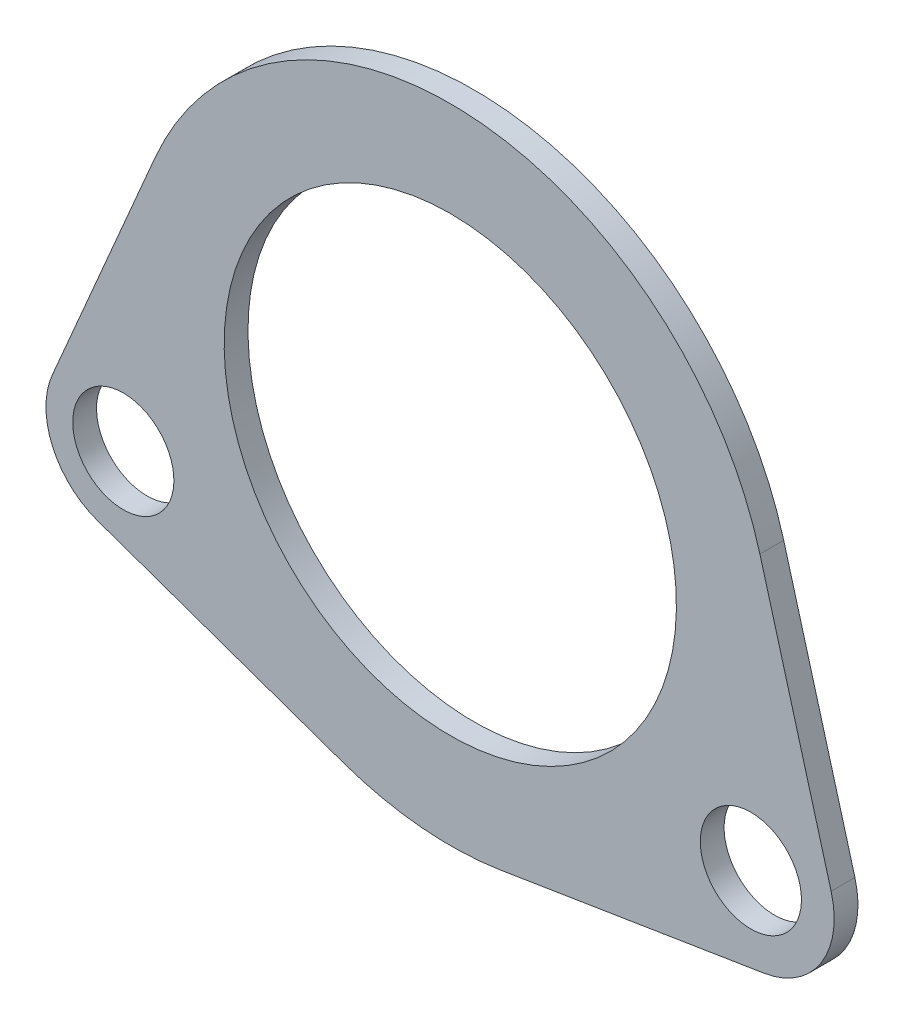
ISO-10303-21;
HEADER;
FILE_DESCRIPTION(('STEP AP214'),'2;1');
FILE_NAME('part.step','',(''),(''),'','','');
FILE_SCHEMA(('AUTOMOTIVE_DESIGN { 1 0 10303 214 1 1 1 1 }'));
ENDSEC;
DATA;
#1=APPLICATION_CONTEXT('core data for automotive mechanical design processes');
#2=APPLICATION_PROTOCOL_DEFINITION('international standard','automotive_design',2000,#1);
#3=PRODUCT_CONTEXT('',#1,'mechanical');
#4=PRODUCT('Part','Part','',(#3));
#5=PRODUCT_RELATED_PRODUCT_CATEGORY('part','',(#4));
#6=PRODUCT_DEFINITION_FORMATION('','',#4);
#7=PRODUCT_DEFINITION_CONTEXT('part definition',#1,'design');
#8=PRODUCT_DEFINITION('design','',#6,#7);
#9=PRODUCT_DEFINITION_SHAPE('','',#8);
#10=(LENGTH_UNIT() NAMED_UNIT(*) SI_UNIT(.MILLI.,.METRE.));
#11=(NAMED_UNIT(*) PLANE_ANGLE_UNIT() SI_UNIT($,.RADIAN.));
#12=(NAMED_UNIT(*) SI_UNIT($,.STERADIAN.) SOLID_ANGLE_UNIT());
#13=UNCERTAINTY_MEASURE_WITH_UNIT(LENGTH_MEASURE(1.E-05),#10,'distance_accuracy_value','');
#14=(GEOMETRIC_REPRESENTATION_CONTEXT(3) GLOBAL_UNCERTAINTY_ASSIGNED_CONTEXT((#13)) GLOBAL_UNIT_ASSIGNED_CONTEXT((#10,
#11,#12)) REPRESENTATION_CONTEXT('',''));
#15=CARTESIAN_POINT('',(0.,0.,0.));
#16=DIRECTION('',(0.,0.,1.));
#17=DIRECTION('',(1.,0.,0.));
#18=AXIS2_PLACEMENT_3D('',#15,#16,#17);
#19=CARTESIAN_POINT('',(27.8018102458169,-6.52052736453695,34.3685391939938));
#20=DIRECTION('',(0.,0.,-1.));
#21=DIRECTION('',(0.,1.,0.));
#22=AXIS2_PLACEMENT_3D('',#19,#20,#21);
#23=PLANE('',#22);
#24=CARTESIAN_POINT('',(2.54648871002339,9.6710980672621,34.3685391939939));
#25=DIRECTION('',(0.,0.,-1.));
#26=DIRECTION('',(0.,1.,0.));
#27=AXIS2_PLACEMENT_3D('',#24,#25,#26);
#28=CIRCLE('',#27,19.);
#29=CARTESIAN_POINT('',(2.54648871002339,28.6710980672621,34.368539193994));
#30=VERTEX_POINT('',#29);
#31=EDGE_CURVE('E226',#30,#30,#28,.T.);
#32=ORIENTED_EDGE('',*,*,#31,.F.);
#33=EDGE_LOOP('',(#32));
#34=FACE_BOUND('',#33,.T.);
#35=CARTESIAN_POINT('',(27.8018102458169,-6.52052736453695,34.3685391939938));
#36=DIRECTION('',(0.,0.,-1.));
#37=DIRECTION('',(0.,1.,0.));
#38=AXIS2_PLACEMENT_3D('',#35,#36,#37);
#39=CIRCLE('',#38,7.);
#40=CARTESIAN_POINT('',(34.5464049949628,-4.64691009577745,34.3685391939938));
#41=VERTEX_POINT('',#40);
#42=CARTESIAN_POINT('',(28.9144266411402,-13.4315392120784,34.3685391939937));
#43=VERTEX_POINT('',#42);
#44=EDGE_CURVE('E131',#41,#43,#39,.T.);
#45=ORIENTED_EDGE('',*,*,#44,.T.);
#46=DIRECTION('',(-0.987287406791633,-0.158945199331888,0.));
#47=VECTOR('',#46,1.);
#48=CARTESIAN_POINT('',(28.9144266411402,-13.4315392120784,34.3685391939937));
#49=LINE('',#48,#47);
#50=CARTESIAN_POINT('',(6.83800909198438,-16.985661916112,34.3685391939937));
#51=VERTEX_POINT('',#50);
#52=EDGE_CURVE('E108',#43,#51,#49,.T.);
#53=ORIENTED_EDGE('',*,*,#52,.T.);
#54=CARTESIAN_POINT('',(2.54648871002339,9.6710980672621,34.3685391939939));
#55=DIRECTION('',(0.,0.,-1.));
#56=DIRECTION('',(0.,1.,0.));
#57=AXIS2_PLACEMENT_3D('',#54,#55,#56);
#58=CIRCLE('',#57,27.);
#59=CARTESIAN_POINT('',(-6.4343922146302,-15.7914975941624,34.3685391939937));
#60=VERTEX_POINT('',#59);
#61=EDGE_CURVE('E134',#51,#60,#58,.T.);
#62=ORIENTED_EDGE('',*,*,#61,.T.);
#63=DIRECTION('',(-0.943059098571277,0.332625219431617,0.));
#64=VECTOR('',#63,1.);
#65=CARTESIAN_POINT('',(-6.4343922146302,-15.7914975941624,34.3685391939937));
#66=LINE('',#65,#64);
#67=CARTESIAN_POINT('',(-27.0904005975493,-8.50594218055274,34.3685391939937));
#68=VERTEX_POINT('',#67);
#69=EDGE_CURVE('E136',#60,#68,#66,.T.);
#70=ORIENTED_EDGE('',*,*,#69,.T.);
#71=CARTESIAN_POINT('',(-24.9283366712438,-2.37605803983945,34.3685391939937));
#72=DIRECTION('',(0.,0.,-1.));
#73=DIRECTION('',(0.,1.,0.));
#74=AXIS2_PLACEMENT_3D('',#71,#72,#73);
#75=CIRCLE('',#74,6.49999999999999);
#76=CARTESIAN_POINT('',(-30.901873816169,0.186529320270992,34.3685391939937));
#77=VERTEX_POINT('',#76);
#78=EDGE_CURVE('E138',#68,#77,#75,.T.);
#79=ORIENTED_EDGE('',*,*,#78,.T.);
#80=DIRECTION('',(0.394244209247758,0.919005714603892,0.));
#81=VECTOR('',#80,1.);
#82=CARTESIAN_POINT('',(-22.2666655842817,20.3156917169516,34.3685391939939));
#83=LINE('',#82,#81);
#84=CARTESIAN_POINT('',(-22.2666655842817,20.3156917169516,34.3685391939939));
#85=VERTEX_POINT('',#84);
#86=EDGE_CURVE('E140',#77,#85,#83,.T.);
#87=ORIENTED_EDGE('',*,*,#86,.T.);
#88=CARTESIAN_POINT('',(2.54648871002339,9.6710980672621,34.3685391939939));
#89=DIRECTION('',(0.,0.,-1.));
#90=DIRECTION('',(0.,1.,0.));
#91=AXIS2_PLACEMENT_3D('',#88,#89,#90);
#92=CIRCLE('',#91,27.);
#93=CARTESIAN_POINT('',(28.5613541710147,16.8979075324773,34.3685391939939));
#94=VERTEX_POINT('',#93);
#95=EDGE_CURVE('E49',#85,#94,#92,.T.);
#96=ORIENTED_EDGE('',*,*,#95,.T.);
#97=DIRECTION('',(0.267659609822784,-0.963513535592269,0.));
#98=VECTOR('',#97,1.);
#99=CARTESIAN_POINT('',(34.5464049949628,-4.64691009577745,34.3685391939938));
#100=LINE('',#99,#98);
#101=EDGE_CURVE('E44',#94,#41,#100,.T.);
#102=ORIENTED_EDGE('',*,*,#101,.T.);
#103=EDGE_LOOP('',(#45,#53,#62,#70,#79,#87,#96,#102));
#104=FACE_BOUND('',#103,.T.);
#105=CARTESIAN_POINT('',(27.8018102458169,-6.52052736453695,34.3685391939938));
#106=DIRECTION('',(0.,0.,-1.));
#107=DIRECTION('',(0.,1.,0.));
#108=AXIS2_PLACEMENT_3D('',#105,#106,#107);
#109=CIRCLE('',#108,4.25000000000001);
#110=CARTESIAN_POINT('',(27.8018102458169,-2.27052736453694,34.3685391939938));
#111=VERTEX_POINT('',#110);
#112=EDGE_CURVE('E113',#111,#111,#109,.T.);
#113=ORIENTED_EDGE('',*,*,#112,.F.);
#114=EDGE_LOOP('',(#113));
#115=FACE_BOUND('',#114,.T.);
#116=CARTESIAN_POINT('',(-24.9283366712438,-2.37605803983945,34.3685391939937));
#117=DIRECTION('',(0.,0.,-1.));
#118=DIRECTION('',(0.,1.,0.));
#119=AXIS2_PLACEMENT_3D('',#116,#117,#118);
#120=CIRCLE('',#119,4.25000000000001);
#121=CARTESIAN_POINT('',(-24.9283366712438,1.87394196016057,34.3685391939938));
#122=VERTEX_POINT('',#121);
#123=EDGE_CURVE('E215',#122,#122,#120,.T.);
#124=ORIENTED_EDGE('',*,*,#123,.F.);
#125=EDGE_LOOP('',(#124));
#126=FACE_BOUND('',#125,.T.);
#127=ADVANCED_FACE('F29',(#34,#104,#115,#126),#23,.T.);
#128=CARTESIAN_POINT('',(27.8018102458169,-6.52052736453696,36.3685391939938));
#129=DIRECTION('',(0.,0.,-1.));
#130=DIRECTION('',(0.,1.,0.));
#131=AXIS2_PLACEMENT_3D('',#128,#129,#130);
#132=PLANE('',#131);
#133=CARTESIAN_POINT('',(2.54648871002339,9.67109806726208,36.3685391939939));
#134=DIRECTION('',(0.,0.,-1.));
#135=DIRECTION('',(0.,1.,0.));
#136=AXIS2_PLACEMENT_3D('',#133,#134,#135);
#137=CIRCLE('',#136,19.);
#138=CARTESIAN_POINT('',(2.54648871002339,28.6710980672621,36.368539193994));
#139=VERTEX_POINT('',#138);
#140=EDGE_CURVE('E221',#139,#139,#137,.T.);
#141=ORIENTED_EDGE('',*,*,#140,.T.);
#142=EDGE_LOOP('',(#141));
#143=FACE_BOUND('',#142,.T.);
#144=CARTESIAN_POINT('',(27.8018102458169,-6.52052736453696,36.3685391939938));
#145=DIRECTION('',(0.,0.,-1.));
#146=DIRECTION('',(0.,1.,0.));
#147=AXIS2_PLACEMENT_3D('',#144,#145,#146);
#148=CIRCLE('',#147,7.);
#149=CARTESIAN_POINT('',(34.5464049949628,-4.64691009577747,36.3685391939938));
#150=VERTEX_POINT('',#149);
#151=CARTESIAN_POINT('',(28.9144266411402,-13.4315392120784,36.3685391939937));
#152=VERTEX_POINT('',#151);
#153=EDGE_CURVE('E99',#150,#152,#148,.T.);
#154=ORIENTED_EDGE('',*,*,#153,.F.);
#155=DIRECTION('',(0.267659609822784,-0.963513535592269,0.));
#156=VECTOR('',#155,1.);
#157=CARTESIAN_POINT('',(34.5464049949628,-4.64691009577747,36.3685391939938));
#158=LINE('',#157,#156);
#159=CARTESIAN_POINT('',(28.5613541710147,16.8979075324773,36.368539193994));
#160=VERTEX_POINT('',#159);
#161=EDGE_CURVE('E129',#160,#150,#158,.T.);
#162=ORIENTED_EDGE('',*,*,#161,.F.);
#163=CARTESIAN_POINT('',(2.54648871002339,9.67109806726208,36.3685391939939));
#164=DIRECTION('',(0.,0.,-1.));
#165=DIRECTION('',(0.,1.,0.));
#166=AXIS2_PLACEMENT_3D('',#163,#164,#165);
#167=CIRCLE('',#166,27.);
#168=CARTESIAN_POINT('',(-22.2666655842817,20.3156917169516,36.3685391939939));
#169=VERTEX_POINT('',#168);
#170=EDGE_CURVE('E127',#169,#160,#167,.T.);
#171=ORIENTED_EDGE('',*,*,#170,.F.);
#172=DIRECTION('',(0.394244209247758,0.919005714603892,0.));
#173=VECTOR('',#172,1.);
#174=CARTESIAN_POINT('',(-22.2666655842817,20.3156917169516,36.3685391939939));
#175=LINE('',#174,#173);
#176=CARTESIAN_POINT('',(-30.9018738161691,0.186529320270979,36.3685391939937));
#177=VERTEX_POINT('',#176);
#178=EDGE_CURVE('E125',#177,#169,#175,.T.);
#179=ORIENTED_EDGE('',*,*,#178,.F.);
#180=CARTESIAN_POINT('',(-24.9283366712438,-2.37605803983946,36.3685391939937));
#181=DIRECTION('',(0.,0.,-1.));
#182=DIRECTION('',(0.,1.,0.));
#183=AXIS2_PLACEMENT_3D('',#180,#181,#182);
#184=CIRCLE('',#183,6.49999999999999);
#185=CARTESIAN_POINT('',(-27.0904005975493,-8.50594218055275,36.3685391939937));
#186=VERTEX_POINT('',#185);
#187=EDGE_CURVE('E123',#186,#177,#184,.T.);
#188=ORIENTED_EDGE('',*,*,#187,.F.);
#189=DIRECTION('',(-0.943059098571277,0.332625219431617,0.));
#190=VECTOR('',#189,1.);
#191=CARTESIAN_POINT('',(-6.43439221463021,-15.7914975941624,36.3685391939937));
#192=LINE('',#191,#190);
#193=CARTESIAN_POINT('',(-6.43439221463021,-15.7914975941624,36.3685391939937));
#194=VERTEX_POINT('',#193);
#195=EDGE_CURVE('E121',#194,#186,#192,.T.);
#196=ORIENTED_EDGE('',*,*,#195,.F.);
#197=CARTESIAN_POINT('',(2.54648871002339,9.67109806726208,36.3685391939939));
#198=DIRECTION('',(0.,0.,-1.));
#199=DIRECTION('',(0.,1.,0.));
#200=AXIS2_PLACEMENT_3D('',#197,#198,#199);
#201=CIRCLE('',#200,27.);
#202=CARTESIAN_POINT('',(6.83800909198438,-16.985661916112,36.3685391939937));
#203=VERTEX_POINT('',#202);
#204=EDGE_CURVE('E101',#203,#194,#201,.T.);
#205=ORIENTED_EDGE('',*,*,#204,.F.);
#206=DIRECTION('',(-0.987287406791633,-0.158945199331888,0.));
#207=VECTOR('',#206,1.);
#208=CARTESIAN_POINT('',(28.9144266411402,-13.4315392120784,36.3685391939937));
#209=LINE('',#208,#207);
#210=EDGE_CURVE('E94',#152,#203,#209,.T.);
#211=ORIENTED_EDGE('',*,*,#210,.F.);
#212=EDGE_LOOP('',(#154,#162,#171,#179,#188,#196,#205,#211));
#213=FACE_BOUND('',#212,.T.);
#214=CARTESIAN_POINT('',(27.8018102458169,-6.52052736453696,36.3685391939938));
#215=DIRECTION('',(0.,0.,-1.));
#216=DIRECTION('',(0.,1.,0.));
#217=AXIS2_PLACEMENT_3D('',#214,#215,#216);
#218=CIRCLE('',#217,4.25000000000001);
#219=CARTESIAN_POINT('',(27.8018102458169,-2.27052736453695,36.3685391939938));
#220=VERTEX_POINT('',#219);
#221=EDGE_CURVE('E116',#220,#220,#218,.T.);
#222=ORIENTED_EDGE('',*,*,#221,.T.);
#223=EDGE_LOOP('',(#222));
#224=FACE_BOUND('',#223,.T.);
#225=CARTESIAN_POINT('',(-24.9283366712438,-2.37605803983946,36.3685391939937));
#226=DIRECTION('',(0.,0.,-1.));
#227=DIRECTION('',(0.,1.,0.));
#228=AXIS2_PLACEMENT_3D('',#225,#226,#227);
#229=CIRCLE('',#228,4.25000000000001);
#230=CARTESIAN_POINT('',(-24.9283366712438,1.87394196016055,36.3685391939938));
#231=VERTEX_POINT('',#230);
#232=EDGE_CURVE('E218',#231,#231,#229,.T.);
#233=ORIENTED_EDGE('',*,*,#232,.T.);
#234=EDGE_LOOP('',(#233));
#235=FACE_BOUND('',#234,.T.);
#236=ADVANCED_FACE('F95',(#143,#213,#224,#235),#132,.F.);
#237=CARTESIAN_POINT('',(27.8018102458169,-6.52052736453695,34.3685391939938));
#238=DIRECTION('',(0.,0.,1.));
#239=DIRECTION('',(0.,-1.,0.));
#240=AXIS2_PLACEMENT_3D('',#237,#238,#239);
#241=CYLINDRICAL_SURFACE('',#240,7.);
#242=ORIENTED_EDGE('',*,*,#153,.T.);
#243=DIRECTION('',(0.,0.,1.));
#244=VECTOR('',#243,1.);
#245=CARTESIAN_POINT('',(28.9144266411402,-13.4315392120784,34.3685391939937));
#246=LINE('',#245,#244);
#247=EDGE_CURVE('E11',#43,#152,#246,.T.);
#248=ORIENTED_EDGE('',*,*,#247,.F.);
#249=ORIENTED_EDGE('',*,*,#44,.F.);
#250=DIRECTION('',(0.,0.,1.));
#251=VECTOR('',#250,1.);
#252=CARTESIAN_POINT('',(34.5464049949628,-4.64691009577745,34.3685391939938));
#253=LINE('',#252,#251);
#254=EDGE_CURVE('E112',#41,#150,#253,.T.);
#255=ORIENTED_EDGE('',*,*,#254,.T.);
#256=EDGE_LOOP('',(#242,#248,#249,#255));
#257=FACE_BOUND('',#256,.T.);
#258=ADVANCED_FACE('F31',(#257),#241,.T.);
#259=CARTESIAN_POINT('',(28.9144266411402,-13.4315392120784,34.3685391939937));
#260=DIRECTION('',(-0.158945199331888,0.987287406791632,0.));
#261=DIRECTION('',(-0.987287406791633,-0.158945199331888,0.));
#262=AXIS2_PLACEMENT_3D('',#259,#260,#261);
#263=PLANE('',#262);
#264=ORIENTED_EDGE('',*,*,#210,.T.);
#265=DIRECTION('',(0.,0.,1.));
#266=VECTOR('',#265,1.);
#267=CARTESIAN_POINT('',(6.83800909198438,-16.985661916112,34.3685391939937));
#268=LINE('',#267,#266);
#269=EDGE_CURVE('E37',#51,#203,#268,.T.);
#270=ORIENTED_EDGE('',*,*,#269,.F.);
#271=ORIENTED_EDGE('',*,*,#52,.F.);
#272=ORIENTED_EDGE('',*,*,#247,.T.);
#273=EDGE_LOOP('',(#264,#270,#271,#272));
#274=FACE_BOUND('',#273,.T.);
#275=ADVANCED_FACE('F107',(#274),#263,.F.);
#276=CARTESIAN_POINT('',(2.54648871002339,9.6710980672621,34.3685391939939));
#277=DIRECTION('',(0.,0.,1.));
#278=DIRECTION('',(0.,-1.,0.));
#279=AXIS2_PLACEMENT_3D('',#276,#277,#278);
#280=CYLINDRICAL_SURFACE('',#279,27.);
#281=ORIENTED_EDGE('',*,*,#204,.T.);
#282=DIRECTION('',(0.,0.,1.));
#283=VECTOR('',#282,1.);
#284=CARTESIAN_POINT('',(-6.4343922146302,-15.7914975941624,34.3685391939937));
#285=LINE('',#284,#283);
#286=EDGE_CURVE('E157',#60,#194,#285,.T.);
#287=ORIENTED_EDGE('',*,*,#286,.F.);
#288=ORIENTED_EDGE('',*,*,#61,.F.);
#289=ORIENTED_EDGE('',*,*,#269,.T.);
#290=EDGE_LOOP('',(#281,#287,#288,#289));
#291=FACE_BOUND('',#290,.T.);
#292=ADVANCED_FACE('F161',(#291),#280,.T.);
#293=CARTESIAN_POINT('',(-6.4343922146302,-15.7914975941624,34.3685391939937));
#294=DIRECTION('',(0.332625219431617,0.943059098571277,0.));
#295=DIRECTION('',(-0.943059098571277,0.332625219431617,0.));
#296=AXIS2_PLACEMENT_3D('',#293,#294,#295);
#297=PLANE('',#296);
#298=ORIENTED_EDGE('',*,*,#195,.T.);
#299=DIRECTION('',(0.,0.,1.));
#300=VECTOR('',#299,1.);
#301=CARTESIAN_POINT('',(-27.0904005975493,-8.50594218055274,34.3685391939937));
#302=LINE('',#301,#300);
#303=EDGE_CURVE('E154',#68,#186,#302,.T.);
#304=ORIENTED_EDGE('',*,*,#303,.F.);
#305=ORIENTED_EDGE('',*,*,#69,.F.);
#306=ORIENTED_EDGE('',*,*,#286,.T.);
#307=EDGE_LOOP('',(#298,#304,#305,#306));
#308=FACE_BOUND('',#307,.T.);
#309=ADVANCED_FACE('F169',(#308),#297,.F.);
#310=CARTESIAN_POINT('',(-24.9283366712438,-2.37605803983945,34.3685391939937));
#311=DIRECTION('',(0.,0.,1.));
#312=DIRECTION('',(0.,-1.,0.));
#313=AXIS2_PLACEMENT_3D('',#310,#311,#312);
#314=CYLINDRICAL_SURFACE('',#313,6.49999999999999);
#315=ORIENTED_EDGE('',*,*,#187,.T.);
#316=DIRECTION('',(0.,0.,1.));
#317=VECTOR('',#316,1.);
#318=CARTESIAN_POINT('',(-30.901873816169,0.186529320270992,34.3685391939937));
#319=LINE('',#318,#317);
#320=EDGE_CURVE('E151',#77,#177,#319,.T.);
#321=ORIENTED_EDGE('',*,*,#320,.F.);
#322=ORIENTED_EDGE('',*,*,#78,.F.);
#323=ORIENTED_EDGE('',*,*,#303,.T.);
#324=EDGE_LOOP('',(#315,#321,#322,#323));
#325=FACE_BOUND('',#324,.T.);
#326=ADVANCED_FACE('F172',(#325),#314,.T.);
#327=CARTESIAN_POINT('',(-22.2666655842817,20.3156917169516,34.3685391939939));
#328=DIRECTION('',(0.919005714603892,-0.394244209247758,0.));
#329=DIRECTION('',(0.394244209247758,0.919005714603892,0.));
#330=AXIS2_PLACEMENT_3D('',#327,#328,#329);
#331=PLANE('',#330);
#332=ORIENTED_EDGE('',*,*,#178,.T.);
#333=DIRECTION('',(0.,0.,1.));
#334=VECTOR('',#333,1.);
#335=CARTESIAN_POINT('',(-22.2666655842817,20.3156917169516,34.3685391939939));
#336=LINE('',#335,#334);
#337=EDGE_CURVE('E148',#85,#169,#336,.T.);
#338=ORIENTED_EDGE('',*,*,#337,.F.);
#339=ORIENTED_EDGE('',*,*,#86,.F.);
#340=ORIENTED_EDGE('',*,*,#320,.T.);
#341=EDGE_LOOP('',(#332,#338,#339,#340));
#342=FACE_BOUND('',#341,.T.);
#343=ADVANCED_FACE('F177',(#342),#331,.F.);
#344=CARTESIAN_POINT('',(2.54648871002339,9.6710980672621,34.3685391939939));
#345=DIRECTION('',(0.,0.,1.));
#346=DIRECTION('',(0.,-1.,0.));
#347=AXIS2_PLACEMENT_3D('',#344,#345,#346);
#348=CYLINDRICAL_SURFACE('',#347,27.);
#349=ORIENTED_EDGE('',*,*,#170,.T.);
#350=DIRECTION('',(0.,0.,1.));
#351=VECTOR('',#350,1.);
#352=CARTESIAN_POINT('',(28.5613541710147,16.8979075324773,34.3685391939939));
#353=LINE('',#352,#351);
#354=EDGE_CURVE('E145',#94,#160,#353,.T.);
#355=ORIENTED_EDGE('',*,*,#354,.F.);
#356=ORIENTED_EDGE('',*,*,#95,.F.);
#357=ORIENTED_EDGE('',*,*,#337,.T.);
#358=EDGE_LOOP('',(#349,#355,#356,#357));
#359=FACE_BOUND('',#358,.T.);
#360=ADVANCED_FACE('F180',(#359),#348,.T.);
#361=CARTESIAN_POINT('',(34.5464049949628,-4.64691009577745,34.3685391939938));
#362=DIRECTION('',(-0.963513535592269,-0.267659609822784,0.));
#363=DIRECTION('',(0.267659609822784,-0.963513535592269,0.));
#364=AXIS2_PLACEMENT_3D('',#361,#362,#363);
#365=PLANE('',#364);
#366=ORIENTED_EDGE('',*,*,#161,.T.);
#367=ORIENTED_EDGE('',*,*,#254,.F.);
#368=ORIENTED_EDGE('',*,*,#101,.F.);
#369=ORIENTED_EDGE('',*,*,#354,.T.);
#370=EDGE_LOOP('',(#366,#367,#368,#369));
#371=FACE_BOUND('',#370,.T.);
#372=ADVANCED_FACE('F182',(#371),#365,.F.);
#373=CARTESIAN_POINT('',(27.8018102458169,-6.52052736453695,34.3685391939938));
#374=DIRECTION('',(0.,0.,1.));
#375=DIRECTION('',(0.,-1.,0.));
#376=AXIS2_PLACEMENT_3D('',#373,#374,#375);
#377=CYLINDRICAL_SURFACE('',#376,4.25000000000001);
#378=ORIENTED_EDGE('',*,*,#112,.T.);
#379=EDGE_LOOP('',(#378));
#380=FACE_BOUND('',#379,.T.);
#381=ORIENTED_EDGE('',*,*,#221,.F.);
#382=EDGE_LOOP('',(#381));
#383=FACE_BOUND('',#382,.T.);
#384=ADVANCED_FACE('F184',(#380,#383),#377,.F.);
#385=CARTESIAN_POINT('',(2.54648871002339,9.6710980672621,34.3685391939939));
#386=DIRECTION('',(0.,0.,1.));
#387=DIRECTION('',(0.,-1.,0.));
#388=AXIS2_PLACEMENT_3D('',#385,#386,#387);
#389=CYLINDRICAL_SURFACE('',#388,19.);
#390=ORIENTED_EDGE('',*,*,#31,.T.);
#391=EDGE_LOOP('',(#390));
#392=FACE_BOUND('',#391,.T.);
#393=ORIENTED_EDGE('',*,*,#140,.F.);
#394=EDGE_LOOP('',(#393));
#395=FACE_BOUND('',#394,.T.);
#396=ADVANCED_FACE('F190',(#392,#395),#389,.F.);
#397=CARTESIAN_POINT('',(-24.9283366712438,-2.37605803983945,34.3685391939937));
#398=DIRECTION('',(0.,0.,1.));
#399=DIRECTION('',(0.,-1.,0.));
#400=AXIS2_PLACEMENT_3D('',#397,#398,#399);
#401=CYLINDRICAL_SURFACE('',#400,4.25000000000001);
#402=ORIENTED_EDGE('',*,*,#123,.T.);
#403=EDGE_LOOP('',(#402));
#404=FACE_BOUND('',#403,.T.);
#405=ORIENTED_EDGE('',*,*,#232,.F.);
#406=EDGE_LOOP('',(#405));
#407=FACE_BOUND('',#406,.T.);
#408=ADVANCED_FACE('F206',(#404,#407),#401,.F.);
#409=CLOSED_SHELL('',(#127,#236,#258,#275,#292,#309,#326,#343,#360,#372,#384,#396,#408));
#410=MANIFOLD_SOLID_BREP('B2',#409);
#411=ADVANCED_BREP_SHAPE_REPRESENTATION('',(#18,#410),#14);
#412=SHAPE_DEFINITION_REPRESENTATION(#9,#411);
ENDSEC;
END-ISO-10303-21;
